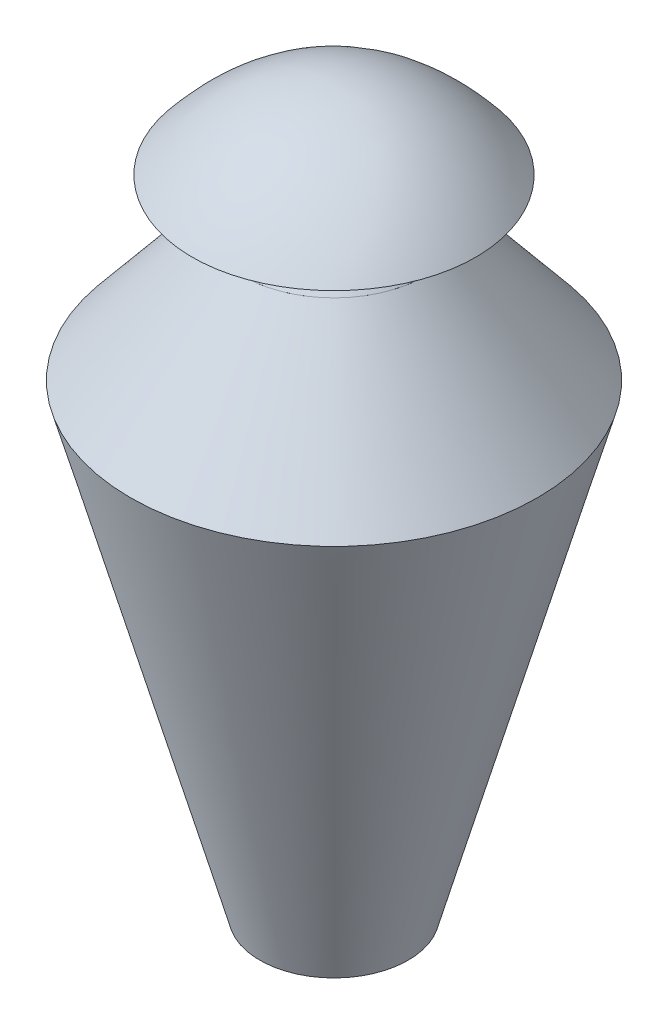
from build123d import *


with BuildPart() as part:
    # Sketch1 → Revolve1 (revolve)
    with BuildSketch(Plane.XY, mode=Mode.PRIVATE) as revolve1_sk:
        Polygon((11.351226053, 0), (31.08803459, 71.077775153), (13.956326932, 91.86681366), (6.617850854, 0), align=None)
    revolve(revolve1_sk.sketch.rotate(Axis((0, 0, 0), (0, 1, 0)), 90), axis=Axis((0, 0, 0), (0, 1, 0)))


solid = part.part
